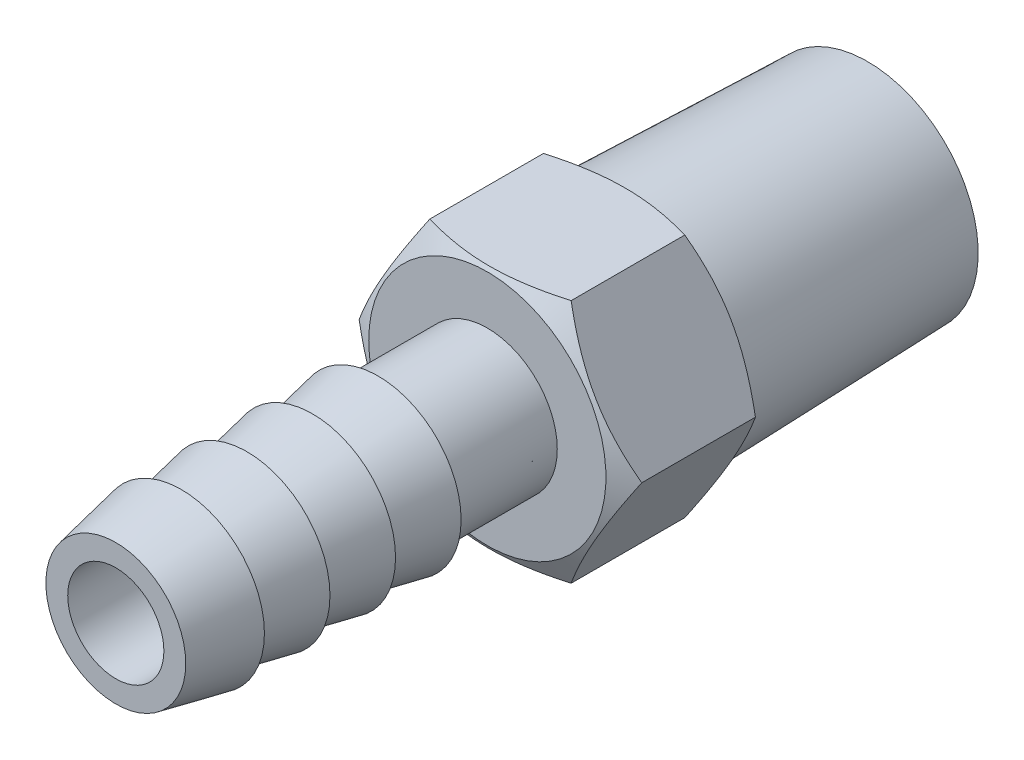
ISO-10303-21;
HEADER;
FILE_DESCRIPTION(('STEP AP214'),'2;1');
FILE_NAME('part.step','',(''),(''),'','','');
FILE_SCHEMA(('AUTOMOTIVE_DESIGN { 1 0 10303 214 1 1 1 1 }'));
ENDSEC;
DATA;
#1=APPLICATION_CONTEXT('core data for automotive mechanical design processes');
#2=APPLICATION_PROTOCOL_DEFINITION('international standard','automotive_design',2000,#1);
#3=PRODUCT_CONTEXT('',#1,'mechanical');
#4=PRODUCT('Part','Part','',(#3));
#5=PRODUCT_RELATED_PRODUCT_CATEGORY('part','',(#4));
#6=PRODUCT_DEFINITION_FORMATION('','',#4);
#7=PRODUCT_DEFINITION_CONTEXT('part definition',#1,'design');
#8=PRODUCT_DEFINITION('design','',#6,#7);
#9=PRODUCT_DEFINITION_SHAPE('','',#8);
#10=(LENGTH_UNIT() NAMED_UNIT(*) SI_UNIT(.MILLI.,.METRE.));
#11=(NAMED_UNIT(*) PLANE_ANGLE_UNIT() SI_UNIT($,.RADIAN.));
#12=(NAMED_UNIT(*) SI_UNIT($,.STERADIAN.) SOLID_ANGLE_UNIT());
#13=UNCERTAINTY_MEASURE_WITH_UNIT(LENGTH_MEASURE(1.E-05),#10,'distance_accuracy_value','');
#14=(GEOMETRIC_REPRESENTATION_CONTEXT(3) GLOBAL_UNCERTAINTY_ASSIGNED_CONTEXT((#13)) GLOBAL_UNIT_ASSIGNED_CONTEXT((#10,
#11,#12)) REPRESENTATION_CONTEXT('',''));
#15=CARTESIAN_POINT('',(0.,0.,0.));
#16=DIRECTION('',(0.,0.,1.));
#17=DIRECTION('',(1.,0.,0.));
#18=AXIS2_PLACEMENT_3D('',#15,#16,#17);
#19=CARTESIAN_POINT('',(4.10611511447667,-7.11199999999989,-4.44089209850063E-13));
#20=DIRECTION('',(0.,0.,-1.));
#21=DIRECTION('',(-0.999999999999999,0.,0.));
#22=AXIS2_PLACEMENT_3D('',#19,#20,#21);
#23=PLANE('',#22);
#24=CARTESIAN_POINT('',(0.,0.,0.));
#25=DIRECTION('',(0.,0.,-1.));
#26=DIRECTION('',(-0.999999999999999,0.,0.));
#27=AXIS2_PLACEMENT_3D('',#24,#25,#26);
#28=CIRCLE('',#27,6.89240751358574);
#29=CARTESIAN_POINT('',(-6.89240751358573,0.,0.));
#30=VERTEX_POINT('',#29);
#31=EDGE_CURVE('E116',#30,#30,#28,.T.);
#32=ORIENTED_EDGE('',*,*,#31,.T.);
#33=EDGE_LOOP('',(#32));
#34=FACE_BOUND('',#33,.T.);
#35=CARTESIAN_POINT('',(0.,0.,0.));
#36=DIRECTION('',(0.,0.,-1.));
#37=DIRECTION('',(-0.999999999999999,0.,0.));
#38=AXIS2_PLACEMENT_3D('',#35,#36,#37);
#39=CIRCLE('',#38,6.858);
#40=CARTESIAN_POINT('',(-6.858,0.,0.));
#41=VERTEX_POINT('',#40);
#42=EDGE_CURVE('E128',#41,#41,#39,.T.);
#43=ORIENTED_EDGE('',*,*,#42,.F.);
#44=EDGE_LOOP('',(#43));
#45=FACE_BOUND('',#44,.T.);
#46=ADVANCED_FACE('F32',(#34,#45),#23,.T.);
#47=CARTESIAN_POINT('',(4.10611511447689,-7.112,8.12800000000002));
#48=DIRECTION('',(0.,0.,-1.));
#49=DIRECTION('',(-0.999999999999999,0.,0.));
#50=AXIS2_PLACEMENT_3D('',#47,#48,#49);
#51=PLANE('',#50);
#52=CARTESIAN_POINT('',(3.33066907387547E-13,1.76941794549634E-13,8.12799999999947));
#53=DIRECTION('',(0.,0.,1.));
#54=DIRECTION('',(0.999999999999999,0.,0.));
#55=AXIS2_PLACEMENT_3D('',#52,#53,#54);
#56=CIRCLE('',#55,4.064);
#57=CARTESIAN_POINT('',(4.06400000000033,1.76716197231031E-13,8.12799999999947));
#58=VERTEX_POINT('',#57);
#59=EDGE_CURVE('E246',#58,#58,#56,.T.);
#60=ORIENTED_EDGE('',*,*,#59,.F.);
#61=EDGE_LOOP('',(#60));
#62=FACE_BOUND('',#61,.T.);
#63=CARTESIAN_POINT('',(3.33066907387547E-13,1.76941794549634E-13,8.12799999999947));
#64=DIRECTION('',(0.,0.,-1.));
#65=DIRECTION('',(-0.999999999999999,0.,0.));
#66=AXIS2_PLACEMENT_3D('',#63,#64,#65);
#67=CIRCLE('',#66,6.89240751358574);
#68=CARTESIAN_POINT('',(-6.8924075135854,1.77324400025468E-13,8.12799999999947));
#69=VERTEX_POINT('',#68);
#70=EDGE_CURVE('E37',#69,#69,#67,.T.);
#71=ORIENTED_EDGE('',*,*,#70,.F.);
#72=EDGE_LOOP('',(#71));
#73=FACE_BOUND('',#72,.T.);
#74=ADVANCED_FACE('F150',(#62,#73),#51,.F.);
#75=CARTESIAN_POINT('',(6.66133814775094E-13,0.,7.36599999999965));
#76=DIRECTION('',(0.,0.,-1.));
#77=DIRECTION('',(-0.999999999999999,0.,0.));
#78=AXIS2_PLACEMENT_3D('',#75,#76,#77);
#79=CONICAL_SURFACE('',#78,8.21223022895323,1.0471975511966);
#80=ORIENTED_EDGE('',*,*,#70,.T.);
#81=EDGE_LOOP('',(#80));
#82=FACE_BOUND('',#81,.T.);
#83=CARTESIAN_POINT('',(4.10599964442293,-7.11219999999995,7.36593333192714));
#84=CARTESIAN_POINT('',(4.19625667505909,-6.955870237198,7.41803539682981));
#85=CARTESIAN_POINT('',(4.28685022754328,-6.79895760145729,7.46777287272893));
#86=CARTESIAN_POINT('',(4.46877304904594,-6.48385803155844,7.56186739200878));
#87=CARTESIAN_POINT('',(4.56010261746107,-6.32567057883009,7.6062221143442));
#88=CARTESIAN_POINT('',(4.83555361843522,-5.84857545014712,7.73034153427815));
#89=CARTESIAN_POINT('',(5.02076234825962,-5.52778452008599,7.80093924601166));
#90=CARTESIAN_POINT('',(5.29792384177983,-5.04772673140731,7.8837233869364));
#91=CARTESIAN_POINT('',(5.38904848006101,-4.88989422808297,7.90730619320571));
#92=CARTESIAN_POINT('',(5.57170949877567,-4.57351606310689,7.94685112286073));
#93=CARTESIAN_POINT('',(5.66324584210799,-4.41497046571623,7.96281391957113));
#94=CARTESIAN_POINT('',(5.84647750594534,-4.09760391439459,7.98671201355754));
#95=CARTESIAN_POINT('',(5.93817252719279,-3.93878347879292,7.99465642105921));
#96=CARTESIAN_POINT('',(6.12164220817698,-3.62100466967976,8.00235591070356));
#97=CARTESIAN_POINT('',(6.21341686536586,-3.46204630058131,8.00211124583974));
#98=CARTESIAN_POINT('',(6.46484880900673,-3.02655339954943,7.9901846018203));
#99=CARTESIAN_POINT('',(6.62442378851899,-2.75016142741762,7.97016327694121));
#100=CARTESIAN_POINT('',(6.94251386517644,-2.19921325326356,7.90667580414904));
#101=CARTESIAN_POINT('',(7.10102784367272,-1.92465898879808,7.8631879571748));
#102=CARTESIAN_POINT('',(7.41975806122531,-1.37260205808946,7.75448108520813));
#103=CARTESIAN_POINT('',(7.5799340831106,-1.09516905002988,7.68880148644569));
#104=CARTESIAN_POINT('',(7.89789746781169,-0.544440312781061,7.53973534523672));
#105=CARTESIAN_POINT('',(8.05568890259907,-0.27113753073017,7.45638381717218));
#106=CARTESIAN_POINT('',(8.21234569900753,0.000200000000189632,7.36593333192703));
#107=B_SPLINE_CURVE_WITH_KNOTS('',3,(#83,#84,#85,#86,#87,#88,#89,#90,#91,#92,#93,#94,#95,#96,
#97,#98,#99,#100,#101,#102,#103,#104,#105,#106),.UNSPECIFIED.,.F.,.F.,(4,2,2,2,2,2,2,2,2,2,2,4),
(0.,0.563603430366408,1.12744902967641,2.2574831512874,2.80866066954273,3.35978947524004,
3.91029139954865,4.46077631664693,5.41910279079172,6.37831693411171,7.35880500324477,
8.33736823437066),.UNSPECIFIED.);
#108=CARTESIAN_POINT('',(4.10611511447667,-7.11199999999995,7.36599999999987));
#109=VERTEX_POINT('',#108);
#110=CARTESIAN_POINT('',(8.21223022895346,0.,7.36599999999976));
#111=VERTEX_POINT('',#110);
#112=EDGE_CURVE('E203',#109,#111,#107,.T.);
#113=ORIENTED_EDGE('',*,*,#112,.T.);
#114=CARTESIAN_POINT('',(8.21234569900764,-0.000200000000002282,7.36593333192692));
#115=CARTESIAN_POINT('',(8.12208866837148,0.156129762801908,7.41803539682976));
#116=CARTESIAN_POINT('',(8.03149511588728,0.313042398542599,7.46777287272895));
#117=CARTESIAN_POINT('',(7.8495722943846,0.628141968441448,7.56186739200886));
#118=CARTESIAN_POINT('',(7.75824272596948,0.786329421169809,7.60622211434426));
#119=CARTESIAN_POINT('',(7.48279172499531,1.26342454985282,7.73034153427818));
#120=CARTESIAN_POINT('',(7.2975829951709,1.58421547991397,7.8009392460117));
#121=CARTESIAN_POINT('',(7.02042150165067,2.06427326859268,7.88372338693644));
#122=CARTESIAN_POINT('',(6.92929686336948,2.22210577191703,7.90730619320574));
#123=CARTESIAN_POINT('',(6.74663584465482,2.53848393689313,7.94685112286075));
#124=CARTESIAN_POINT('',(6.65509950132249,2.69702953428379,7.96281391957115));
#125=CARTESIAN_POINT('',(6.47186783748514,3.01439608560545,7.98671201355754));
#126=CARTESIAN_POINT('',(6.38017281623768,3.17321652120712,7.99465642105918));
#127=CARTESIAN_POINT('',(6.19670313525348,3.49099533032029,8.00235591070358));
#128=CARTESIAN_POINT('',(6.1049284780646,3.64995369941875,8.00211124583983));
#129=CARTESIAN_POINT('',(5.85349653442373,4.08544660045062,7.99018460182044));
#130=CARTESIAN_POINT('',(5.69392155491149,4.36183857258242,7.97016327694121));
#131=CARTESIAN_POINT('',(5.37583147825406,4.91278674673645,7.90667580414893));
#132=CARTESIAN_POINT('',(5.21731749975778,5.18734101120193,7.86318795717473));
#133=CARTESIAN_POINT('',(4.8985872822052,5.73939794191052,7.75448108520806));
#134=CARTESIAN_POINT('',(4.73841126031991,6.01683094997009,7.68880148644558));
#135=CARTESIAN_POINT('',(4.42044787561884,6.56755968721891,7.53973534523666));
#136=CARTESIAN_POINT('',(4.26265644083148,6.84086246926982,7.45638381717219));
#137=CARTESIAN_POINT('',(4.10599964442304,7.11220000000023,7.36593333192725));
#138=B_SPLINE_CURVE_WITH_KNOTS('',3,(#114,#115,#116,#117,#118,#119,#120,#121,#122,#123,#124,
#125,#126,#127,#128,#129,#130,#131,#132,#133,#134,#135,#136,#137),.UNSPECIFIED.,.F.,.F.,(4,2,2,
2,2,2,2,2,2,2,2,4),(0.,0.563603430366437,1.12744902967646,2.25748315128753,2.80866066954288,
3.35978947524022,3.91029139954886,4.46077631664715,5.4191027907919,6.37831693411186,
7.35880500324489,8.33736823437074),.UNSPECIFIED.);
#139=CARTESIAN_POINT('',(4.10611511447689,7.112,7.36599999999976));
#140=VERTEX_POINT('',#139);
#141=EDGE_CURVE('E198',#111,#140,#138,.T.);
#142=ORIENTED_EDGE('',*,*,#141,.T.);
#143=CARTESIAN_POINT('',(-10.8724474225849,7.112,4.60642989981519));
#144=CARTESIAN_POINT('',(-10.5603268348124,7.112,4.75719073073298));
#145=CARTESIAN_POINT('',(-10.2474663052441,7.112,4.90644747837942));
#146=CARTESIAN_POINT('',(-9.6198651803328,7.112,5.20109290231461));
#147=CARTESIAN_POINT('',(-9.30512426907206,7.112,5.34648090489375));
#148=CARTESIAN_POINT('',(-8.67165327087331,7.112,5.63329869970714));
#149=CARTESIAN_POINT('',(-8.35291065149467,7.112,5.77470091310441));
#150=CARTESIAN_POINT('',(-7.71279917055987,7.112,6.05140640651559));
#151=CARTESIAN_POINT('',(-7.39143044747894,7.112,6.18671000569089));
#152=CARTESIAN_POINT('',(-6.74164774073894,7.112,6.45116857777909));
#153=CARTESIAN_POINT('',(-6.41319550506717,7.112,6.58023008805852));
#154=CARTESIAN_POINT('',(-5.75241156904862,7.112,6.82820116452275));
#155=CARTESIAN_POINT('',(-5.42007944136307,7.112,6.94710960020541));
#156=CARTESIAN_POINT('',(-4.7516913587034,7.112,7.17156616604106));
#157=CARTESIAN_POINT('',(-4.41564510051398,7.112,7.27714285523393));
#158=CARTESIAN_POINT('',(-3.73878811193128,7.112,7.4714975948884));
#159=CARTESIAN_POINT('',(-3.39797892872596,7.112,7.56028097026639));
#160=CARTESIAN_POINT('',(-2.71129932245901,7.112,7.71672274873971));
#161=CARTESIAN_POINT('',(-2.36542736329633,7.112,7.78437459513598));
#162=CARTESIAN_POINT('',(-1.84359121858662,7.112,7.86660617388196));
#163=CARTESIAN_POINT('',(-1.66911982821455,7.112,7.89081076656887));
#164=CARTESIAN_POINT('',(-1.31936448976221,7.112,7.93232813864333));
#165=CARTESIAN_POINT('',(-1.1440806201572,7.112,7.94964157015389));
#166=CARTESIAN_POINT('',(-0.794039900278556,7.112,7.97691139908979));
#167=CARTESIAN_POINT('',(-0.6192865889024,7.112,7.98691304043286));
#168=CARTESIAN_POINT('',(-0.269513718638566,7.112,7.99950670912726));
#169=CARTESIAN_POINT('',(-0.0944941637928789,7.112,8.00209884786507));
#170=CARTESIAN_POINT('',(0.255447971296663,7.112,7.99981184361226));
#171=CARTESIAN_POINT('',(0.430370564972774,7.112,7.99493478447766));
#172=CARTESIAN_POINT('',(0.779858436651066,7.112,7.97783019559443));
#173=CARTESIAN_POINT('',(0.954423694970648,7.11200000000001,7.96560227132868));
#174=CARTESIAN_POINT('',(1.37795298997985,7.11200000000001,7.92727165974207));
#175=CARTESIAN_POINT('',(1.6265880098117,7.11200000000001,7.89746185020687));
#176=CARTESIAN_POINT('',(2.12189843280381,7.112,7.82459378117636));
#177=CARTESIAN_POINT('',(2.36857353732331,7.112,7.78153354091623));
#178=CARTESIAN_POINT('',(3.10609516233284,7.112,7.63463810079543));
#179=CARTESIAN_POINT('',(3.5934729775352,7.112,7.51318660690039));
#180=CARTESIAN_POINT('',(4.32247428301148,7.112,7.30391516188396));
#181=CARTESIAN_POINT('',(4.567910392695,7.112,7.22862419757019));
#182=CARTESIAN_POINT('',(5.05641163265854,7.112,7.07057054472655));
#183=CARTESIAN_POINT('',(5.29947654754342,7.112,6.98780718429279));
#184=CARTESIAN_POINT('',(5.78202202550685,7.112,6.81657952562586));
#185=CARTESIAN_POINT('',(6.02151508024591,7.112,6.72815007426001));
#186=CARTESIAN_POINT('',(6.49846529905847,7.11200000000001,6.54619233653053));
#187=CARTESIAN_POINT('',(6.73592313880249,7.11200000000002,6.45266582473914));
#188=CARTESIAN_POINT('',(6.97252441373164,7.11200000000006,6.35706839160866));
#189=B_SPLINE_CURVE_WITH_KNOTS('',3,(#143,#144,#145,#146,#147,#148,#149,#150,#151,#152,#153,
#154,#155,#156,#157,#158,#159,#160,#161,#162,#163,#164,#165,#166,#167,#168,#169,#170,#171,#172,
#173,#174,#175,#176,#177,#178,#179,#180,#181,#182,#183,#184,#185,#186,#187,#188),.UNSPECIFIED.,
.F.,.F.,(4,2,2,2,2,2,2,2,2,2,2,2,2,2,2,2,2,2,2,2,2,2,4),(0.,1.03988557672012,2.07995107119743,
3.12599920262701,4.17199252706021,5.23055951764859,6.2892442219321,7.34562110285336,
8.40166245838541,9.45803115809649,9.98634345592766,10.5146057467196,11.0395709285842,
11.5645282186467,12.0893390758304,12.6141781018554,13.3649981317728,14.1159304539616,
15.6206922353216,16.3908071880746,17.1609914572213,17.9268248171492,18.692393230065),.UNSPECIFIED.);
#190=CARTESIAN_POINT('',(-4.10611511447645,7.11200000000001,7.36599999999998));
#191=VERTEX_POINT('',#190);
#192=EDGE_CURVE('E191',#140,#191,#189,.F.);
#193=ORIENTED_EDGE('',*,*,#192,.T.);
#194=CARTESIAN_POINT('',(-4.1059996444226,7.11220000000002,7.36593333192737));
#195=CARTESIAN_POINT('',(-4.1962566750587,6.95587023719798,7.41803539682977));
#196=CARTESIAN_POINT('',(-4.28685022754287,6.79895760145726,7.46777287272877));
#197=CARTESIAN_POINT('',(-4.4687730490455,6.48385803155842,7.56186739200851));
#198=CARTESIAN_POINT('',(-4.56010261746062,6.3256705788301,7.60622211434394));
#199=CARTESIAN_POINT('',(-4.83555361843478,5.84857545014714,7.7303415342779));
#200=CARTESIAN_POINT('',(-5.02076234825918,5.52778452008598,7.80093924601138));
#201=CARTESIAN_POINT('',(-5.2979238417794,5.04772673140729,7.88372338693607));
#202=CARTESIAN_POINT('',(-5.38904848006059,4.88989422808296,7.90730619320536));
#203=CARTESIAN_POINT('',(-5.57170949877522,4.57351606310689,7.94685112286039));
#204=CARTESIAN_POINT('',(-5.66324584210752,4.41497046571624,7.96281391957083));
#205=CARTESIAN_POINT('',(-5.84647750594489,4.09760391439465,7.98671201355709));
#206=CARTESIAN_POINT('',(-5.93817252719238,3.93878347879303,7.99465642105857));
#207=CARTESIAN_POINT('',(-6.1216422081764,3.62100466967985,8.00235591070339));
#208=CARTESIAN_POINT('',(-6.21341686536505,3.46204630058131,8.00211124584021));
#209=CARTESIAN_POINT('',(-6.46484880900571,3.02655339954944,7.9901846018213));
#210=CARTESIAN_POINT('',(-6.62442378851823,2.7501614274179,7.97016327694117));
#211=CARTESIAN_POINT('',(-6.94251386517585,2.19921325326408,7.90667580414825));
#212=CARTESIAN_POINT('',(-7.10102784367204,1.92465898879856,7.8631879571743));
#213=CARTESIAN_POINT('',(-7.41975806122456,1.37260205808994,7.75448108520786));
#214=CARTESIAN_POINT('',(-7.57993408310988,1.09516905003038,7.68880148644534));
#215=CARTESIAN_POINT('',(-7.89789746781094,0.544440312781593,7.53973534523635));
#216=CARTESIAN_POINT('',(-8.05568890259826,0.271137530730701,7.45638381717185));
#217=CARTESIAN_POINT('',(-8.21234569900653,-0.000199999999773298,7.36593333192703));
#218=B_SPLINE_CURVE_WITH_KNOTS('',3,(#194,#195,#196,#197,#198,#199,#200,#201,#202,#203,#204,
#205,#206,#207,#208,#209,#210,#211,#212,#213,#214,#215,#216,#217),.UNSPECIFIED.,.F.,.F.,(4,2,2,
2,2,2,2,2,2,2,2,4),(0.,0.56360343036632,1.12744902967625,2.25748315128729,2.8086606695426,
3.35978947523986,3.9102913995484,4.46077631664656,5.41910279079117,6.37831693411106,
7.35880500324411,8.33736823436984),.UNSPECIFIED.);
#219=CARTESIAN_POINT('',(-8.21223022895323,0.,7.36599999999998));
#220=VERTEX_POINT('',#219);
#221=EDGE_CURVE('E185',#191,#220,#218,.T.);
#222=ORIENTED_EDGE('',*,*,#221,.T.);
#223=CARTESIAN_POINT('',(-8.21234569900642,0.000200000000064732,7.36593333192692));
#224=CARTESIAN_POINT('',(-8.12208866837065,-0.156129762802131,7.41803539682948));
#225=CARTESIAN_POINT('',(-8.03149511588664,-0.313042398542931,7.46777287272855));
#226=CARTESIAN_POINT('',(-7.84957229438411,-0.628141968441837,7.56186739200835));
#227=CARTESIAN_POINT('',(-7.75824272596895,-0.786329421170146,7.60622211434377));
#228=CARTESIAN_POINT('',(-7.48279172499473,-1.26342454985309,7.73034153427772));
#229=CARTESIAN_POINT('',(-7.29758299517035,-1.58421547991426,7.80093924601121));
#230=CARTESIAN_POINT('',(-7.02042150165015,-2.06427326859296,7.88372338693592));
#231=CARTESIAN_POINT('',(-6.92929686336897,-2.22210577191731,7.90730619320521));
#232=CARTESIAN_POINT('',(-6.7466358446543,-2.53848393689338,7.94685112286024));
#233=CARTESIAN_POINT('',(-6.65509950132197,-2.69702953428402,7.96281391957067));
#234=CARTESIAN_POINT('',(-6.47186783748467,-3.01439608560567,7.98671201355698));
#235=CARTESIAN_POINT('',(-6.38017281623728,-3.17321652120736,7.99465642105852));
#236=CARTESIAN_POINT('',(-6.19670313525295,-3.4909953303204,8.00235591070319));
#237=CARTESIAN_POINT('',(-6.10492847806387,-3.64995369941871,8.00211124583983));
#238=CARTESIAN_POINT('',(-5.85349653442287,-4.08544660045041,7.99018460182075));
#239=CARTESIAN_POINT('',(-5.693921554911,-4.36183857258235,7.97016327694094));
#240=CARTESIAN_POINT('',(-5.37583147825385,-4.91278674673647,7.90667580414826));
#241=CARTESIAN_POINT('',(-5.21731749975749,-5.18734101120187,7.86318795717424));
#242=CARTESIAN_POINT('',(-4.89858728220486,-5.73939794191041,7.75448108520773));
#243=CARTESIAN_POINT('',(-4.73841126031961,-6.01683094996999,7.68880148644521));
#244=CARTESIAN_POINT('',(-4.42044787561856,-6.56755968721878,7.53973534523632));
#245=CARTESIAN_POINT('',(-4.26265644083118,-6.84086246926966,7.45638381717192));
#246=CARTESIAN_POINT('',(-4.1059996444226,-7.11220000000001,7.36593333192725));
#247=B_SPLINE_CURVE_WITH_KNOTS('',3,(#223,#224,#225,#226,#227,#228,#229,#230,#231,#232,#233,
#234,#235,#236,#237,#238,#239,#240,#241,#242,#243,#244,#245,#246),.UNSPECIFIED.,.F.,.F.,(4,2,2,
2,2,2,2,2,2,2,2,4),(0.,0.563603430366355,1.12744902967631,2.25748315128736,2.80866066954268,
3.35978947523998,3.91029139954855,4.46077631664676,5.41910279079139,6.37831693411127,
7.35880500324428,8.33736823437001),.UNSPECIFIED.);
#248=CARTESIAN_POINT('',(-4.10611511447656,-7.11199999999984,7.36599999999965));
#249=VERTEX_POINT('',#248);
#250=EDGE_CURVE('E50',#220,#249,#247,.T.);
#251=ORIENTED_EDGE('',*,*,#250,.T.);
#252=CARTESIAN_POINT('',(-10.872447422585,-7.11199999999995,4.60642989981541));
#253=CARTESIAN_POINT('',(-10.5603268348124,-7.11199999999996,4.75719073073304));
#254=CARTESIAN_POINT('',(-10.2474663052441,-7.11199999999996,4.90644747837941));
#255=CARTESIAN_POINT('',(-9.61986518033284,-7.11199999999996,5.20109290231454));
#256=CARTESIAN_POINT('',(-9.30512426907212,-7.11199999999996,5.34648090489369));
#257=CARTESIAN_POINT('',(-8.6716532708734,-7.11199999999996,5.63329869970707));
#258=CARTESIAN_POINT('',(-8.35291065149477,-7.11199999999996,5.77470091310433));
#259=CARTESIAN_POINT('',(-7.71279917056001,-7.11199999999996,6.0514064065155));
#260=CARTESIAN_POINT('',(-7.39143044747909,-7.11199999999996,6.18671000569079));
#261=CARTESIAN_POINT('',(-6.74164774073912,-7.11199999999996,6.45116857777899));
#262=CARTESIAN_POINT('',(-6.41319550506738,-7.11199999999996,6.5802300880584));
#263=CARTESIAN_POINT('',(-5.75241156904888,-7.11199999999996,6.82820116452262));
#264=CARTESIAN_POINT('',(-5.42007944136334,-7.11199999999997,6.94710960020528));
#265=CARTESIAN_POINT('',(-4.75169135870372,-7.11199999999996,7.17156616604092));
#266=CARTESIAN_POINT('',(-4.41564510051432,-7.11199999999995,7.27714285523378));
#267=CARTESIAN_POINT('',(-3.73878811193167,-7.11199999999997,7.47149759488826));
#268=CARTESIAN_POINT('',(-3.39797892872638,-7.112,7.56028097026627));
#269=CARTESIAN_POINT('',(-2.71129932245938,-7.112,7.71672274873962));
#270=CARTESIAN_POINT('',(-2.36542736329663,-7.11199999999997,7.78437459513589));
#271=CARTESIAN_POINT('',(-1.8435912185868,-7.11199999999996,7.86660617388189));
#272=CARTESIAN_POINT('',(-1.6691198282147,-7.11199999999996,7.8908107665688));
#273=CARTESIAN_POINT('',(-1.31936448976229,-7.11199999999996,7.93232813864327));
#274=CARTESIAN_POINT('',(-1.14408062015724,-7.11199999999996,7.94964157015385));
#275=CARTESIAN_POINT('',(-0.794039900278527,-7.11199999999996,7.97691139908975));
#276=CARTESIAN_POINT('',(-0.619286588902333,-7.11199999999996,7.98691304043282));
#277=CARTESIAN_POINT('',(-0.269513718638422,-7.11199999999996,7.99950670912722));
#278=CARTESIAN_POINT('',(-0.0944941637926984,-7.11199999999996,8.00209884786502));
#279=CARTESIAN_POINT('',(0.255447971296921,-7.11199999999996,7.99981184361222));
#280=CARTESIAN_POINT('',(0.430370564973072,-7.11199999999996,7.99493478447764));
#281=CARTESIAN_POINT('',(0.779858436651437,-7.11199999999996,7.97783019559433));
#282=CARTESIAN_POINT('',(0.954423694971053,-7.11199999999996,7.96560227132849));
#283=CARTESIAN_POINT('',(1.37795298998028,-7.11199999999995,7.92727165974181));
#284=CARTESIAN_POINT('',(1.62658800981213,-7.11199999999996,7.89746185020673));
#285=CARTESIAN_POINT('',(2.12189843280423,-7.11199999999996,7.82459378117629));
#286=CARTESIAN_POINT('',(2.36857353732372,-7.11199999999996,7.78153354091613));
#287=CARTESIAN_POINT('',(3.1060951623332,-7.11199999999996,7.63463810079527));
#288=CARTESIAN_POINT('',(3.59347297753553,-7.11199999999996,7.51318660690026));
#289=CARTESIAN_POINT('',(4.32247428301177,-7.11199999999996,7.30391516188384));
#290=CARTESIAN_POINT('',(4.56791039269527,-7.11199999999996,7.22862419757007));
#291=CARTESIAN_POINT('',(5.05641163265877,-7.11199999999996,7.07057054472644));
#292=CARTESIAN_POINT('',(5.29947654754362,-7.11199999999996,6.98780718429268));
#293=CARTESIAN_POINT('',(5.78202202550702,-7.11199999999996,6.81657952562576));
#294=CARTESIAN_POINT('',(6.02151508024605,-7.11199999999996,6.72815007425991));
#295=CARTESIAN_POINT('',(6.49846529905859,-7.11199999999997,6.54619233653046));
#296=CARTESIAN_POINT('',(6.7359231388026,-7.11199999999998,6.45266582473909));
#297=CARTESIAN_POINT('',(6.97252441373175,-7.11200000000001,6.35706839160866));
#298=B_SPLINE_CURVE_WITH_KNOTS('',3,(#252,#253,#254,#255,#256,#257,#258,#259,#260,#261,#262,
#263,#264,#265,#266,#267,#268,#269,#270,#271,#272,#273,#274,#275,#276,#277,#278,#279,#280,#281,
#282,#283,#284,#285,#286,#287,#288,#289,#290,#291,#292,#293,#294,#295,#296,#297),.UNSPECIFIED.,
.F.,.F.,(4,2,2,2,2,2,2,2,2,2,2,2,2,2,2,2,2,2,2,2,2,2,4),(0.,1.03988557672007,2.07995107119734,
3.12599920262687,4.17199252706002,5.23055951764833,6.28924422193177,7.34562110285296,
8.40166245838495,9.45803115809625,9.98634345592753,10.5146057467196,11.0395709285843,
11.5645282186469,12.0893390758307,12.6141781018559,13.3649981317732,14.1159304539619,
15.6206922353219,16.3908071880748,17.1609914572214,17.9268248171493,18.6923932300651),.UNSPECIFIED.);
#299=EDGE_CURVE('E155',#249,#109,#298,.T.);
#300=ORIENTED_EDGE('',*,*,#299,.T.);
#301=EDGE_LOOP('',(#113,#142,#193,#222,#251,#300));
#302=FACE_BOUND('',#301,.T.);
#303=ADVANCED_FACE('F172',(#82,#302),#79,.T.);
#304=CARTESIAN_POINT('',(4.10611511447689,-7.112,8.12800000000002));
#305=DIRECTION('',(-0.866025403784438,0.5,0.));
#306=DIRECTION('',(-0.500000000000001,-0.866025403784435,0.));
#307=AXIS2_PLACEMENT_3D('',#304,#305,#306);
#308=PLANE('',#307);
#309=CARTESIAN_POINT('',(8.21234569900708,0.000199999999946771,0.762066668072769));
#310=CARTESIAN_POINT('',(8.12208866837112,-0.156129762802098,0.709964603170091));
#311=CARTESIAN_POINT('',(8.03149511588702,-0.313042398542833,0.660227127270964));
#312=CARTESIAN_POINT('',(7.84957229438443,-0.62814196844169,0.566132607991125));
#313=CARTESIAN_POINT('',(7.75824272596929,-0.786329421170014,0.52177788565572));
#314=CARTESIAN_POINT('',(7.4827917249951,-1.26342454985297,0.397658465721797));
#315=CARTESIAN_POINT('',(7.29758299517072,-1.58421547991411,0.327060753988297));
#316=CARTESIAN_POINT('',(7.02042150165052,-2.0642732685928,0.244276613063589));
#317=CARTESIAN_POINT('',(6.92929686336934,-2.22210577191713,0.220693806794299));
#318=CARTESIAN_POINT('',(6.74663584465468,-2.53848393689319,0.181148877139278));
#319=CARTESIAN_POINT('',(6.65509950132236,-2.69702953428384,0.165186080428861));
#320=CARTESIAN_POINT('',(6.47186783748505,-3.01439608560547,0.141287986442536));
#321=CARTESIAN_POINT('',(6.38017281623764,-3.17321652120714,0.133343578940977));
#322=CARTESIAN_POINT('',(6.19670313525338,-3.49099533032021,0.125644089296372));
#323=CARTESIAN_POINT('',(6.1049284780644,-3.64995369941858,0.125888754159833));
#324=CARTESIAN_POINT('',(5.85349653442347,-4.08544660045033,0.13781539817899));
#325=CARTESIAN_POINT('',(5.69392155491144,-4.36183857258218,0.157836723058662));
#326=CARTESIAN_POINT('',(5.37583147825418,-4.91278674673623,0.221324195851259));
#327=CARTESIAN_POINT('',(5.21731749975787,-5.18734101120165,0.264812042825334));
#328=CARTESIAN_POINT('',(4.89858728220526,-5.7393979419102,0.373518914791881));
#329=CARTESIAN_POINT('',(4.73841126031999,-6.01683094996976,0.439198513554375));
#330=CARTESIAN_POINT('',(4.42044787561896,-6.56755968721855,0.588264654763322));
#331=CARTESIAN_POINT('',(4.26265644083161,-6.84086246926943,0.671616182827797));
#332=CARTESIAN_POINT('',(4.10599964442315,-7.1121999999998,0.762066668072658));
#333=B_SPLINE_CURVE_WITH_KNOTS('',3,(#309,#310,#311,#312,#313,#314,#315,#316,#317,#318,#319,
#320,#321,#322,#323,#324,#325,#326,#327,#328,#329,#330,#331,#332),.UNSPECIFIED.,.F.,.F.,(4,2,2,
2,2,2,2,2,2,2,2,4),(0.,0.563603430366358,1.12744902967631,2.25748315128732,2.80866066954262,
3.3597894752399,3.91029139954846,4.46077631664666,5.4191027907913,6.37831693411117,
7.35880500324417,8.33736823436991),.UNSPECIFIED.);
#334=CARTESIAN_POINT('',(8.21223022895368,0.,0.761999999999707));
#335=VERTEX_POINT('',#334);
#336=CARTESIAN_POINT('',(4.106115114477,-7.1119999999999,0.76200000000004));
#337=VERTEX_POINT('',#336);
#338=EDGE_CURVE('E58',#335,#337,#333,.T.);
#339=ORIENTED_EDGE('',*,*,#338,.F.);
#340=DIRECTION('',(0.,0.,-1.));
#341=VECTOR('',#340,1.);
#342=CARTESIAN_POINT('',(8.21223022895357,0.,8.12799999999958));
#343=LINE('',#342,#341);
#344=EDGE_CURVE('E11',#111,#335,#343,.T.);
#345=ORIENTED_EDGE('',*,*,#344,.F.);
#346=ORIENTED_EDGE('',*,*,#112,.F.);
#347=DIRECTION('',(0.,0.,-1.));
#348=VECTOR('',#347,1.);
#349=CARTESIAN_POINT('',(4.10611511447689,-7.112,8.12800000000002));
#350=LINE('',#349,#348);
#351=EDGE_CURVE('E111',#109,#337,#350,.T.);
#352=ORIENTED_EDGE('',*,*,#351,.T.);
#353=EDGE_LOOP('',(#339,#345,#346,#352));
#354=FACE_BOUND('',#353,.T.);
#355=ADVANCED_FACE('F34',(#354),#308,.F.);
#356=CARTESIAN_POINT('',(8.21223022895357,0.,8.12799999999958));
#357=DIRECTION('',(-0.866025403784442,-0.499999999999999,0.));
#358=DIRECTION('',(0.500000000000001,-0.866025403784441,0.));
#359=AXIS2_PLACEMENT_3D('',#356,#357,#358);
#360=PLANE('',#359);
#361=CARTESIAN_POINT('',(4.10599964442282,7.11220000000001,0.762066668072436));
#362=CARTESIAN_POINT('',(4.19625667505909,6.95587023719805,0.709964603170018));
#363=CARTESIAN_POINT('',(4.28685022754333,6.79895760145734,0.660227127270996));
#364=CARTESIAN_POINT('',(4.46877304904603,6.48385803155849,0.566132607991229));
#365=CARTESIAN_POINT('',(4.56010261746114,6.32567057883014,0.521777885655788));
#366=CARTESIAN_POINT('',(4.8355536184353,5.84857545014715,0.397658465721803));
#367=CARTESIAN_POINT('',(5.02076234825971,5.52778452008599,0.327060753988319));
#368=CARTESIAN_POINT('',(5.29792384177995,5.04772673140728,0.244276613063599));
#369=CARTESIAN_POINT('',(5.38904848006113,4.88989422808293,0.220693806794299));
#370=CARTESIAN_POINT('',(5.5717094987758,4.57351606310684,0.181148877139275));
#371=CARTESIAN_POINT('',(5.66324584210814,4.41497046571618,0.165186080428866));
#372=CARTESIAN_POINT('',(5.84647750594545,4.09760391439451,0.141287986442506));
#373=CARTESIAN_POINT('',(5.93817252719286,3.93878347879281,0.133343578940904));
#374=CARTESIAN_POINT('',(6.12164220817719,3.62100466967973,0.125644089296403));
#375=CARTESIAN_POINT('',(6.21341686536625,3.46204630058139,0.125888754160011));
#376=CARTESIAN_POINT('',(6.46484880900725,3.02655339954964,0.137815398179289));
#377=CARTESIAN_POINT('',(6.62442378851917,2.75016142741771,0.157836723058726));
#378=CARTESIAN_POINT('',(6.94251386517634,2.19921325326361,0.221324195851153));
#379=CARTESIAN_POINT('',(7.10102784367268,1.92465898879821,0.264812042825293));
#380=CARTESIAN_POINT('',(7.41975806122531,1.3726020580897,0.37351891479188));
#381=CARTESIAN_POINT('',(7.57993408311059,1.09516905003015,0.439198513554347));
#382=CARTESIAN_POINT('',(7.89789746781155,0.544440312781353,0.588264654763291));
#383=CARTESIAN_POINT('',(8.05568890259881,0.271137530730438,0.67161618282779));
#384=CARTESIAN_POINT('',(8.21234569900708,-0.000200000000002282,0.762066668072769));
#385=B_SPLINE_CURVE_WITH_KNOTS('',3,(#361,#362,#363,#364,#365,#366,#367,#368,#369,#370,#371,
#372,#373,#374,#375,#376,#377,#378,#379,#380,#381,#382,#383,#384),.UNSPECIFIED.,.F.,.F.,(4,2,2,
2,2,2,2,2,2,2,2,4),(0.,0.563603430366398,1.1274490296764,2.25748315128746,2.80866066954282,
3.35978947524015,3.91029139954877,4.46077631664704,5.41910279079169,6.37831693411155,
7.3588050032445,8.33736823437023),.UNSPECIFIED.);
#386=CARTESIAN_POINT('',(4.10611511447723,7.11200000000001,0.761999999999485));
#387=VERTEX_POINT('',#386);
#388=EDGE_CURVE('E215',#387,#335,#385,.T.);
#389=ORIENTED_EDGE('',*,*,#388,.F.);
#390=DIRECTION('',(0.,0.,-1.));
#391=VECTOR('',#390,1.);
#392=CARTESIAN_POINT('',(4.10611511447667,7.112,8.12800000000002));
#393=LINE('',#392,#391);
#394=EDGE_CURVE('E42',#140,#387,#393,.T.);
#395=ORIENTED_EDGE('',*,*,#394,.F.);
#396=ORIENTED_EDGE('',*,*,#141,.F.);
#397=ORIENTED_EDGE('',*,*,#344,.T.);
#398=EDGE_LOOP('',(#389,#395,#396,#397));
#399=FACE_BOUND('',#398,.T.);
#400=ADVANCED_FACE('F208',(#399),#360,.F.);
#401=CARTESIAN_POINT('',(4.10611511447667,7.112,8.12800000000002));
#402=DIRECTION('',(0.,-0.999999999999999,0.));
#403=DIRECTION('',(0.999999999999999,0.,0.));
#404=AXIS2_PLACEMENT_3D('',#401,#402,#403);
#405=PLANE('',#404);
#406=CARTESIAN_POINT('',(-10.8724474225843,7.11200000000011,3.52157010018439));
#407=CARTESIAN_POINT('',(-10.5603268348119,7.11200000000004,3.3708092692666));
#408=CARTESIAN_POINT('',(-10.2474663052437,7.11200000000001,3.22155252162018));
#409=CARTESIAN_POINT('',(-9.61986518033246,7.11199999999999,2.92690709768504));
#410=CARTESIAN_POINT('',(-9.30512426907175,7.112,2.78151909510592));
#411=CARTESIAN_POINT('',(-8.67165327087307,7.112,2.49470130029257));
#412=CARTESIAN_POINT('',(-8.35291065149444,7.112,2.35329908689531));
#413=CARTESIAN_POINT('',(-7.71279917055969,7.112,2.07659359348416));
#414=CARTESIAN_POINT('',(-7.39143044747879,7.112,1.94128999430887));
#415=CARTESIAN_POINT('',(-6.74164774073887,7.112,1.67683142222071));
#416=CARTESIAN_POINT('',(-6.41319550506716,7.112,1.54776991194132));
#417=CARTESIAN_POINT('',(-5.75241156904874,7.112,1.29979883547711));
#418=CARTESIAN_POINT('',(-5.42007944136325,7.112,1.18089039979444));
#419=CARTESIAN_POINT('',(-4.75169135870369,7.112,0.956433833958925));
#420=CARTESIAN_POINT('',(-4.4156451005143,7.112,0.850857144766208));
#421=CARTESIAN_POINT('',(-3.73878811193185,7.112,0.656502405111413));
#422=CARTESIAN_POINT('',(-3.39797892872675,7.112,0.567719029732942));
#423=CARTESIAN_POINT('',(-2.71129932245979,7.112,0.41127725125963));
#424=CARTESIAN_POINT('',(-2.36542736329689,7.112,0.343625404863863));
#425=CARTESIAN_POINT('',(-1.84359121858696,7.112,0.261393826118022));
#426=CARTESIAN_POINT('',(-1.66911982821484,7.112,0.237189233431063));
#427=CARTESIAN_POINT('',(-1.31936448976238,7.112,0.195671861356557));
#428=CARTESIAN_POINT('',(-1.1440806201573,7.112,0.178358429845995));
#429=CARTESIAN_POINT('',(-0.794039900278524,7.112,0.151088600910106));
#430=CARTESIAN_POINT('',(-0.6192865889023,7.112,0.141086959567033));
#431=CARTESIAN_POINT('',(-0.269513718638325,7.112,0.128493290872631));
#432=CARTESIAN_POINT('',(-0.0944941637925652,7.11200000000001,0.125901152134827));
#433=CARTESIAN_POINT('',(0.255447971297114,7.112,0.128188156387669));
#434=CARTESIAN_POINT('',(0.430370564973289,7.11199999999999,0.133065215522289));
#435=CARTESIAN_POINT('',(0.779858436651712,7.11200000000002,0.150169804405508));
#436=CARTESIAN_POINT('',(0.954423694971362,7.11200000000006,0.162397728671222));
#437=CARTESIAN_POINT('',(1.37795298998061,7.11200000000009,0.200728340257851));
#438=CARTESIAN_POINT('',(1.62658800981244,7.11200000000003,0.230538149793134));
#439=CARTESIAN_POINT('',(2.12189843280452,7.11199999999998,0.303406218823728));
#440=CARTESIAN_POINT('',(2.36857353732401,7.11199999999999,0.346466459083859));
#441=CARTESIAN_POINT('',(3.10609516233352,7.11200000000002,0.49336189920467));
#442=CARTESIAN_POINT('',(3.59347297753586,7.11200000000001,0.61481339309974));
#443=CARTESIAN_POINT('',(4.3224742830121,7.112,0.8240848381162));
#444=CARTESIAN_POINT('',(4.5679103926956,7.112,0.899375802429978));
#445=CARTESIAN_POINT('',(5.0564116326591,7.112,1.05742945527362));
#446=CARTESIAN_POINT('',(5.29947654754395,7.11200000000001,1.14019281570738));
#447=CARTESIAN_POINT('',(5.78202202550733,7.112,1.31142047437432));
#448=CARTESIAN_POINT('',(6.02151508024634,7.112,1.39984992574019));
#449=CARTESIAN_POINT('',(6.49846529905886,7.11200000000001,1.58180766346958));
#450=CARTESIAN_POINT('',(6.73592313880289,7.11200000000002,1.67533417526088));
#451=CARTESIAN_POINT('',(6.97252441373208,7.11200000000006,1.77093160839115));
#452=B_SPLINE_CURVE_WITH_KNOTS('',3,(#406,#407,#408,#409,#410,#411,#412,#413,#414,#415,#416,
#417,#418,#419,#420,#421,#422,#423,#424,#425,#426,#427,#428,#429,#430,#431,#432,#433,#434,#435,
#436,#437,#438,#439,#440,#441,#442,#443,#444,#445,#446,#447,#448,#449,#450,#451),.UNSPECIFIED.,
.F.,.F.,(4,2,2,2,2,2,2,2,2,2,2,2,2,2,2,2,2,2,2,2,2,2,4),(0.,1.03988557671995,2.07995107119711,
3.12599920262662,4.17199252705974,5.23055951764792,6.28924422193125,7.34562110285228,
8.40166245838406,9.45803115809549,9.98634345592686,10.514605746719,11.0395709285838,
11.5645282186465,12.0893390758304,12.6141781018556,13.364998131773,14.1159304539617,
15.6206922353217,16.3908071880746,17.1609914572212,17.9268248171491,18.6923932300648),.UNSPECIFIED.);
#453=CARTESIAN_POINT('',(-4.10611511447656,7.11200000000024,0.761999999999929));
#454=VERTEX_POINT('',#453);
#455=EDGE_CURVE('E105',#454,#387,#452,.T.);
#456=ORIENTED_EDGE('',*,*,#455,.F.);
#457=DIRECTION('',(0.,0.,-1.));
#458=VECTOR('',#457,1.);
#459=CARTESIAN_POINT('',(-4.10611511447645,7.112,8.12799999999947));
#460=LINE('',#459,#458);
#461=EDGE_CURVE('E104',#191,#454,#460,.T.);
#462=ORIENTED_EDGE('',*,*,#461,.F.);
#463=ORIENTED_EDGE('',*,*,#192,.F.);
#464=ORIENTED_EDGE('',*,*,#394,.T.);
#465=EDGE_LOOP('',(#456,#462,#463,#464));
#466=FACE_BOUND('',#465,.T.);
#467=ADVANCED_FACE('F211',(#466),#405,.F.);
#468=CARTESIAN_POINT('',(-4.10611511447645,7.112,8.12799999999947));
#469=DIRECTION('',(0.866025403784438,-0.5,0.));
#470=DIRECTION('',(0.500000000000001,0.866025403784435,0.));
#471=AXIS2_PLACEMENT_3D('',#468,#469,#470);
#472=PLANE('',#471);
#473=CARTESIAN_POINT('',(-8.21234569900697,-0.000199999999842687,0.762066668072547));
#474=CARTESIAN_POINT('',(-8.12208866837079,0.156129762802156,0.709964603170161));
#475=CARTESIAN_POINT('',(-8.03149511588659,0.313042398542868,0.660227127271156));
#476=CARTESIAN_POINT('',(-7.84957229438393,0.628141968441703,0.566132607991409));
#477=CARTESIAN_POINT('',(-7.75824272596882,0.786329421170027,0.52177788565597));
#478=CARTESIAN_POINT('',(-7.48279172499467,1.26342454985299,0.397658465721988));
#479=CARTESIAN_POINT('',(-7.29758299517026,1.58421547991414,0.327060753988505));
#480=CARTESIAN_POINT('',(-7.02042150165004,2.06427326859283,0.244276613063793));
#481=CARTESIAN_POINT('',(-6.92929686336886,2.22210577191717,0.220693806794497));
#482=CARTESIAN_POINT('',(-6.74663584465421,2.53848393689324,0.181148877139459));
#483=CARTESIAN_POINT('',(-6.65509950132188,2.69702953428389,0.165186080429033));
#484=CARTESIAN_POINT('',(-6.47186783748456,3.01439608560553,0.141287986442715));
#485=CARTESIAN_POINT('',(-6.38017281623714,3.1732165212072,0.133343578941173));
#486=CARTESIAN_POINT('',(-6.1967031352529,3.49099533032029,0.125644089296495));
#487=CARTESIAN_POINT('',(-6.10492847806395,3.64995369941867,0.125888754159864));
#488=CARTESIAN_POINT('',(-5.85349653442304,4.08544660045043,0.137815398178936));
#489=CARTESIAN_POINT('',(-5.69392155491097,4.36183857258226,0.157836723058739));
#490=CARTESIAN_POINT('',(-5.37583147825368,4.91278674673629,0.221324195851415));
#491=CARTESIAN_POINT('',(-5.21731749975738,5.18734101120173,0.264812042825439));
#492=CARTESIAN_POINT('',(-4.89858728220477,5.73939794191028,0.373518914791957));
#493=CARTESIAN_POINT('',(-4.73841126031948,6.01683094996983,0.439198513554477));
#494=CARTESIAN_POINT('',(-4.42044787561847,6.56755968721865,0.58826465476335));
#495=CARTESIAN_POINT('',(-4.26265644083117,6.84086246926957,0.671616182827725));
#496=CARTESIAN_POINT('',(-4.10599964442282,7.11220000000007,0.762066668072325));
#497=B_SPLINE_CURVE_WITH_KNOTS('',3,(#473,#474,#475,#476,#477,#478,#479,#480,#481,#482,#483,
#484,#485,#486,#487,#488,#489,#490,#491,#492,#493,#494,#495,#496),.UNSPECIFIED.,.F.,.F.,(4,2,2,
2,2,2,2,2,2,2,2,4),(0.,0.563603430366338,1.12744902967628,2.25748315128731,2.80866066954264,
3.35978947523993,3.9102913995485,4.4607763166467,5.41910279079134,6.37831693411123,
7.35880500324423,8.33736823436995),.UNSPECIFIED.);
#498=CARTESIAN_POINT('',(-8.21223022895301,0.,0.761999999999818));
#499=VERTEX_POINT('',#498);
#500=EDGE_CURVE('E89',#499,#454,#497,.T.);
#501=ORIENTED_EDGE('',*,*,#500,.F.);
#502=DIRECTION('',(0.,0.,-1.));
#503=VECTOR('',#502,1.);
#504=CARTESIAN_POINT('',(-8.21223022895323,0.,8.12799999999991));
#505=LINE('',#504,#503);
#506=EDGE_CURVE('E102',#220,#499,#505,.T.);
#507=ORIENTED_EDGE('',*,*,#506,.F.);
#508=ORIENTED_EDGE('',*,*,#221,.F.);
#509=ORIENTED_EDGE('',*,*,#461,.T.);
#510=EDGE_LOOP('',(#501,#507,#508,#509));
#511=FACE_BOUND('',#510,.T.);
#512=ADVANCED_FACE('F100',(#511),#472,.F.);
#513=CARTESIAN_POINT('',(-8.21223022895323,0.,8.12799999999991));
#514=DIRECTION('',(0.866025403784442,0.499999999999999,0.));
#515=DIRECTION('',(-0.5,0.866025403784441,0.));
#516=AXIS2_PLACEMENT_3D('',#513,#514,#515);
#517=PLANE('',#516);
#518=CARTESIAN_POINT('',(-4.10599964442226,-7.1121999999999,0.762066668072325));
#519=CARTESIAN_POINT('',(-4.19625667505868,-6.95587023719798,0.709964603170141));
#520=CARTESIAN_POINT('',(-4.28685022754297,-6.7989576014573,0.660227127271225));
#521=CARTESIAN_POINT('',(-4.4687730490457,-6.4838580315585,0.566132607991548));
#522=CARTESIAN_POINT('',(-4.56010261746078,-6.32567057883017,0.521777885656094));
#523=CARTESIAN_POINT('',(-4.83555361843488,-5.84857545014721,0.397658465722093));
#524=CARTESIAN_POINT('',(-5.02076234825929,-5.52778452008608,0.327060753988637));
#525=CARTESIAN_POINT('',(-5.29792384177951,-5.04772673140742,0.244276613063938));
#526=CARTESIAN_POINT('',(-5.3890484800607,-4.88989422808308,0.220693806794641));
#527=CARTESIAN_POINT('',(-5.57170949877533,-4.57351606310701,0.181148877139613));
#528=CARTESIAN_POINT('',(-5.66324584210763,-4.41497046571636,0.165186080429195));
#529=CARTESIAN_POINT('',(-5.846477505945,-4.09760391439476,0.14128798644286));
#530=CARTESIAN_POINT('',(-5.93817252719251,-3.93878347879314,0.133343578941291));
#531=CARTESIAN_POINT('',(-6.12164220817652,-3.62100466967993,0.125644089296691));
#532=CARTESIAN_POINT('',(-6.21341686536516,-3.46204630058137,0.125888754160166));
#533=CARTESIAN_POINT('',(-6.46484880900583,-3.02655339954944,0.137815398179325));
#534=CARTESIAN_POINT('',(-6.6244237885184,-2.75016142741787,0.157836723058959));
#535=CARTESIAN_POINT('',(-6.94251386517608,-2.19921325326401,0.221324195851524));
#536=CARTESIAN_POINT('',(-7.10102784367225,-1.92465898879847,0.264812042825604));
#537=CARTESIAN_POINT('',(-7.41975806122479,-1.37260205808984,0.373518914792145));
#538=CARTESIAN_POINT('',(-7.57993408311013,-1.09516905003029,0.439198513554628));
#539=CARTESIAN_POINT('',(-7.89789746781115,-0.54444031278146,0.588264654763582));
#540=CARTESIAN_POINT('',(-8.05568890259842,-0.271137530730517,0.671616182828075));
#541=CARTESIAN_POINT('',(-8.21234569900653,0.000200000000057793,0.762066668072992));
#542=B_SPLINE_CURVE_WITH_KNOTS('',3,(#518,#519,#520,#521,#522,#523,#524,#525,#526,#527,#528,
#529,#530,#531,#532,#533,#534,#535,#536,#537,#538,#539,#540,#541),.UNSPECIFIED.,.F.,.F.,(4,2,2,
2,2,2,2,2,2,2,2,4),(0.,0.563603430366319,1.12744902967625,2.25748315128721,2.80866066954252,
3.3597894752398,3.91029139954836,4.46077631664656,5.41910279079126,6.37831693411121,
7.35880500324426,8.33736823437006),.UNSPECIFIED.);
#543=CARTESIAN_POINT('',(-4.10611511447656,-7.11199999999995,0.761999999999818));
#544=VERTEX_POINT('',#543);
#545=EDGE_CURVE('E86',#544,#499,#542,.T.);
#546=ORIENTED_EDGE('',*,*,#545,.F.);
#547=DIRECTION('',(0.,0.,-1.));
#548=VECTOR('',#547,1.);
#549=CARTESIAN_POINT('',(-4.10611511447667,-7.11199999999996,8.12799999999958));
#550=LINE('',#549,#548);
#551=EDGE_CURVE('E108',#249,#544,#550,.T.);
#552=ORIENTED_EDGE('',*,*,#551,.F.);
#553=ORIENTED_EDGE('',*,*,#250,.F.);
#554=ORIENTED_EDGE('',*,*,#506,.T.);
#555=EDGE_LOOP('',(#546,#552,#553,#554));
#556=FACE_BOUND('',#555,.T.);
#557=ADVANCED_FACE('F107',(#556),#517,.F.);
#558=CARTESIAN_POINT('',(-4.10611511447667,-7.11199999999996,8.12799999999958));
#559=DIRECTION('',(0.,0.999999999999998,0.));
#560=DIRECTION('',(0.,0.,1.));
#561=AXIS2_PLACEMENT_3D('',#558,#559,#560);
#562=PLANE('',#561);
#563=CARTESIAN_POINT('',(-10.8724474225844,-7.112,3.52157010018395));
#564=CARTESIAN_POINT('',(-10.5603268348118,-7.11199999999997,3.37080926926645));
#565=CARTESIAN_POINT('',(-10.2474663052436,-7.11199999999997,3.22155252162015));
#566=CARTESIAN_POINT('',(-9.61986518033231,-7.11199999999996,2.92690709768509));
#567=CARTESIAN_POINT('',(-9.30512426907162,-7.11199999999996,2.78151909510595));
#568=CARTESIAN_POINT('',(-8.67165327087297,-7.11199999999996,2.49470130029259));
#569=CARTESIAN_POINT('',(-8.35291065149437,-7.11199999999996,2.35329908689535));
#570=CARTESIAN_POINT('',(-7.71279917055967,-7.11199999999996,2.07659359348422));
#571=CARTESIAN_POINT('',(-7.39143044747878,-7.11199999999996,1.94128999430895));
#572=CARTESIAN_POINT('',(-6.74164774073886,-7.11199999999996,1.67683142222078));
#573=CARTESIAN_POINT('',(-6.41319550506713,-7.11199999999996,1.54776991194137));
#574=CARTESIAN_POINT('',(-5.75241156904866,-7.11199999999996,1.29979883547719));
#575=CARTESIAN_POINT('',(-5.42007944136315,-7.11199999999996,1.18089039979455));
#576=CARTESIAN_POINT('',(-4.75169135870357,-7.11199999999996,0.956433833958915));
#577=CARTESIAN_POINT('',(-4.41564510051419,-7.11199999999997,0.85085714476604));
#578=CARTESIAN_POINT('',(-3.73878811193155,-7.11199999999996,0.65650240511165));
#579=CARTESIAN_POINT('',(-3.39797892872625,-7.11199999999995,0.567719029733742));
#580=CARTESIAN_POINT('',(-2.71129932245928,-7.11199999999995,0.411277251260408));
#581=CARTESIAN_POINT('',(-2.36542736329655,-7.11199999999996,0.343625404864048));
#582=CARTESIAN_POINT('',(-1.84359121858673,-7.11199999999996,0.261393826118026));
#583=CARTESIAN_POINT('',(-1.66911982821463,-7.11199999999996,0.237189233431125));
#584=CARTESIAN_POINT('',(-1.31936448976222,-7.11199999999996,0.195671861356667));
#585=CARTESIAN_POINT('',(-1.14408062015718,-7.11199999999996,0.178358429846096));
#586=CARTESIAN_POINT('',(-0.794039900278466,-7.11199999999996,0.151088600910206));
#587=CARTESIAN_POINT('',(-0.619286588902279,-7.11199999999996,0.141086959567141));
#588=CARTESIAN_POINT('',(-0.269513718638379,-7.11199999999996,0.128493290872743));
#589=CARTESIAN_POINT('',(-0.0944941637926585,-7.11199999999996,0.125901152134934));
#590=CARTESIAN_POINT('',(0.255447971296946,-7.11199999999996,0.12818815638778));
#591=CARTESIAN_POINT('',(0.430370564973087,-7.11199999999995,0.13306521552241));
#592=CARTESIAN_POINT('',(0.779858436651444,-7.11199999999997,0.150169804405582));
#593=CARTESIAN_POINT('',(0.954423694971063,-7.112,0.16239772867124));
#594=CARTESIAN_POINT('',(1.37795298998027,-7.11200000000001,0.200728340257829));
#595=CARTESIAN_POINT('',(1.62658800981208,-7.11199999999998,0.230538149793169));
#596=CARTESIAN_POINT('',(2.12189843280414,-7.11199999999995,0.303406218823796));
#597=CARTESIAN_POINT('',(2.36857353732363,-7.11199999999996,0.346466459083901));
#598=CARTESIAN_POINT('',(3.10609516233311,-7.11199999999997,0.493361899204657));
#599=CARTESIAN_POINT('',(3.59347297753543,-7.11199999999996,0.614813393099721));
#600=CARTESIAN_POINT('',(4.32247428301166,-7.11199999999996,0.824084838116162));
#601=CARTESIAN_POINT('',(4.56791039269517,-7.11199999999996,0.899375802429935));
#602=CARTESIAN_POINT('',(5.05641163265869,-7.11199999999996,1.05742945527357));
#603=CARTESIAN_POINT('',(5.29947654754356,-7.11199999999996,1.14019281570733));
#604=CARTESIAN_POINT('',(5.78202202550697,-7.11199999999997,1.31142047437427));
#605=CARTESIAN_POINT('',(6.021515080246,-7.11199999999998,1.39984992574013));
#606=CARTESIAN_POINT('',(6.49846529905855,-7.11199999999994,1.58180766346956));
#607=CARTESIAN_POINT('',(6.73592313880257,-7.11199999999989,1.6753341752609));
#608=CARTESIAN_POINT('',(6.97252441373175,-7.11199999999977,1.77093160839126));
#609=B_SPLINE_CURVE_WITH_KNOTS('',3,(#563,#564,#565,#566,#567,#568,#569,#570,#571,#572,#573,
#574,#575,#576,#577,#578,#579,#580,#581,#582,#583,#584,#585,#586,#587,#588,#589,#590,#591,#592,
#593,#594,#595,#596,#597,#598,#599,#600,#601,#602,#603,#604,#605,#606,#607,#608),.UNSPECIFIED.,
.F.,.F.,(4,2,2,2,2,2,2,2,2,2,2,2,2,2,2,2,2,2,2,2,2,2,4),(0.,1.03988557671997,2.07995107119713,
3.12599920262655,4.1719925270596,5.23055951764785,6.28924422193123,7.34562110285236,
8.4016624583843,9.45803115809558,9.98634345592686,10.5146057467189,11.0395709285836,
11.5645282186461,12.08933907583,12.6141781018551,13.3649981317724,14.1159304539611,
15.6206922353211,16.390807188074,17.1609914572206,17.9268248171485,18.6923932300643),.UNSPECIFIED.);
#610=EDGE_CURVE('E91',#337,#544,#609,.F.);
#611=ORIENTED_EDGE('',*,*,#610,.F.);
#612=ORIENTED_EDGE('',*,*,#351,.F.);
#613=ORIENTED_EDGE('',*,*,#299,.F.);
#614=ORIENTED_EDGE('',*,*,#551,.T.);
#615=EDGE_LOOP('',(#611,#612,#613,#614));
#616=FACE_BOUND('',#615,.T.);
#617=ADVANCED_FACE('F145',(#616),#562,.F.);
#618=CARTESIAN_POINT('',(4.44089209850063E-13,1.14491749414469E-13,-0.450157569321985));
#619=DIRECTION('',(0.,0.,1.));
#620=DIRECTION('',(0.999999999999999,0.,0.));
#621=AXIS2_PLACEMENT_3D('',#618,#619,#620);
#622=CONICAL_SURFACE('',#621,6.11271173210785,1.0471975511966);
#623=ORIENTED_EDGE('',*,*,#31,.F.);
#624=EDGE_LOOP('',(#623));
#625=FACE_BOUND('',#624,.T.);
#626=ORIENTED_EDGE('',*,*,#338,.T.);
#627=ORIENTED_EDGE('',*,*,#610,.T.);
#628=ORIENTED_EDGE('',*,*,#545,.T.);
#629=ORIENTED_EDGE('',*,*,#500,.T.);
#630=ORIENTED_EDGE('',*,*,#455,.T.);
#631=ORIENTED_EDGE('',*,*,#388,.T.);
#632=EDGE_LOOP('',(#626,#627,#628,#629,#630,#631));
#633=FACE_BOUND('',#632,.T.);
#634=ADVANCED_FACE('F88',(#625,#633),#622,.T.);
#635=CARTESIAN_POINT('',(0.,0.,0.));
#636=DIRECTION('',(0.,0.,1.));
#637=DIRECTION('',(0.999999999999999,0.,0.));
#638=AXIS2_PLACEMENT_3D('',#635,#636,#637);
#639=CONICAL_SURFACE('',#638,6.858,0.0310668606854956);
#640=CARTESIAN_POINT('',(1.11022302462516E-13,0.,-13.9700000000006));
#641=DIRECTION('',(0.,0.,-1.));
#642=DIRECTION('',(-0.999999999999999,0.,0.));
#643=AXIS2_PLACEMENT_3D('',#640,#641,#642);
#644=CIRCLE('',#643,6.42385627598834);
#645=CARTESIAN_POINT('',(-6.42385627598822,0.,-13.9700000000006));
#646=VERTEX_POINT('',#645);
#647=EDGE_CURVE('E118',#646,#646,#644,.T.);
#648=ORIENTED_EDGE('',*,*,#647,.F.);
#649=EDGE_LOOP('',(#648));
#650=FACE_BOUND('',#649,.T.);
#651=ORIENTED_EDGE('',*,*,#42,.T.);
#652=EDGE_LOOP('',(#651));
#653=FACE_BOUND('',#652,.T.);
#654=ADVANCED_FACE('F177',(#650,#653),#639,.T.);
#655=CARTESIAN_POINT('',(2.79400000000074,1.07552855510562E-13,-13.9699999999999));
#656=DIRECTION('',(0.,0.,1.));
#657=DIRECTION('',(0.999999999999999,0.,0.));
#658=AXIS2_PLACEMENT_3D('',#655,#656,#657);
#659=PLANE('',#658);
#660=CARTESIAN_POINT('',(1.11022302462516E-13,0.,-13.9700000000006));
#661=DIRECTION('',(0.,0.,-1.));
#662=DIRECTION('',(-0.999999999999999,0.,0.));
#663=AXIS2_PLACEMENT_3D('',#660,#661,#662);
#664=CIRCLE('',#663,2.794);
#665=CARTESIAN_POINT('',(-2.79399999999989,0.,-13.9700000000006));
#666=VERTEX_POINT('',#665);
#667=EDGE_CURVE('E123',#666,#666,#664,.T.);
#668=ORIENTED_EDGE('',*,*,#667,.F.);
#669=EDGE_LOOP('',(#668));
#670=FACE_BOUND('',#669,.T.);
#671=ORIENTED_EDGE('',*,*,#647,.T.);
#672=EDGE_LOOP('',(#671));
#673=FACE_BOUND('',#672,.T.);
#674=ADVANCED_FACE('F327',(#670,#673),#659,.F.);
#675=CARTESIAN_POINT('',(0.,0.,0.));
#676=DIRECTION('',(0.,0.,-1.));
#677=DIRECTION('',(-0.999999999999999,0.,0.));
#678=AXIS2_PLACEMENT_3D('',#675,#676,#677);
#679=CYLINDRICAL_SURFACE('',#678,2.794);
#680=ORIENTED_EDGE('',*,*,#667,.T.);
#681=EDGE_LOOP('',(#680));
#682=FACE_BOUND('',#681,.T.);
#683=CARTESIAN_POINT('',(0.,0.,29.7179999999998));
#684=DIRECTION('',(0.,0.,1.));
#685=DIRECTION('',(0.999999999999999,0.,0.));
#686=AXIS2_PLACEMENT_3D('',#683,#684,#685);
#687=CIRCLE('',#686,2.794);
#688=CARTESIAN_POINT('',(2.794,0.,29.7179999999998));
#689=VERTEX_POINT('',#688);
#690=EDGE_CURVE('E277',#689,#689,#687,.T.);
#691=ORIENTED_EDGE('',*,*,#690,.T.);
#692=EDGE_LOOP('',(#691));
#693=FACE_BOUND('',#692,.T.);
#694=ADVANCED_FACE('F281',(#682,#693),#679,.F.);
#695=CARTESIAN_POINT('',(0.,0.,0.));
#696=DIRECTION('',(0.,0.,1.));
#697=DIRECTION('',(0.999999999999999,0.,0.));
#698=AXIS2_PLACEMENT_3D('',#695,#696,#697);
#699=CYLINDRICAL_SURFACE('',#698,4.06400000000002);
#700=ORIENTED_EDGE('',*,*,#59,.T.);
#701=EDGE_LOOP('',(#700));
#702=FACE_BOUND('',#701,.T.);
#703=CARTESIAN_POINT('',(3.33066907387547E-13,1.21430643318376E-13,14.4779999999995));
#704=DIRECTION('',(0.,0.,1.));
#705=DIRECTION('',(0.999999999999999,0.,0.));
#706=AXIS2_PLACEMENT_3D('',#703,#704,#705);
#707=CIRCLE('',#706,4.06400000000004);
#708=CARTESIAN_POINT('',(4.06400000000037,1.21205045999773E-13,14.4779999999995));
#709=VERTEX_POINT('',#708);
#710=EDGE_CURVE('E248',#709,#709,#707,.T.);
#711=ORIENTED_EDGE('',*,*,#710,.F.);
#712=EDGE_LOOP('',(#711));
#713=FACE_BOUND('',#712,.T.);
#714=ADVANCED_FACE('F321',(#702,#713),#699,.T.);
#715=CARTESIAN_POINT('',(4.82600000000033,0.,14.478));
#716=DIRECTION('',(0.,0.,-1.));
#717=DIRECTION('',(-0.999999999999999,0.,0.));
#718=AXIS2_PLACEMENT_3D('',#715,#716,#717);
#719=PLANE('',#718);
#720=ORIENTED_EDGE('',*,*,#710,.T.);
#721=EDGE_LOOP('',(#720));
#722=FACE_BOUND('',#721,.T.);
#723=CARTESIAN_POINT('',(3.33066907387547E-13,1.21430643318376E-13,14.4779999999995));
#724=DIRECTION('',(0.,0.,1.));
#725=DIRECTION('',(0.999999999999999,0.,0.));
#726=AXIS2_PLACEMENT_3D('',#723,#724,#725);
#727=CIRCLE('',#726,4.826);
#728=CARTESIAN_POINT('',(4.82600000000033,1.21162746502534E-13,14.4779999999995));
#729=VERTEX_POINT('',#728);
#730=EDGE_CURVE('E253',#729,#729,#727,.T.);
#731=ORIENTED_EDGE('',*,*,#730,.F.);
#732=EDGE_LOOP('',(#731));
#733=FACE_BOUND('',#732,.T.);
#734=ADVANCED_FACE('F317',(#722,#733),#719,.T.);
#735=CARTESIAN_POINT('',(1.11022302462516E-13,1.6306400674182E-13,18.288));
#736=DIRECTION('',(0.,0.,-1.));
#737=DIRECTION('',(-0.999999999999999,0.,0.));
#738=AXIS2_PLACEMENT_3D('',#735,#736,#737);
#739=CONICAL_SURFACE('',#738,4.06400000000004,0.19739555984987);
#740=ORIENTED_EDGE('',*,*,#730,.T.);
#741=EDGE_LOOP('',(#740));
#742=FACE_BOUND('',#741,.T.);
#743=CARTESIAN_POINT('',(1.11022302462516E-13,1.6306400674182E-13,18.288));
#744=DIRECTION('',(0.,0.,1.));
#745=DIRECTION('',(0.999999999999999,0.,0.));
#746=AXIS2_PLACEMENT_3D('',#743,#744,#745);
#747=CIRCLE('',#746,4.06400000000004);
#748=CARTESIAN_POINT('',(4.06400000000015,1.62838409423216E-13,18.288));
#749=VERTEX_POINT('',#748);
#750=EDGE_CURVE('E256',#749,#749,#747,.T.);
#751=ORIENTED_EDGE('',*,*,#750,.F.);
#752=EDGE_LOOP('',(#751));
#753=FACE_BOUND('',#752,.T.);
#754=ADVANCED_FACE('F313',(#742,#753),#739,.T.);
#755=CARTESIAN_POINT('',(4.826,0.,18.288));
#756=DIRECTION('',(0.,0.,-1.));
#757=DIRECTION('',(-0.999999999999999,0.,0.));
#758=AXIS2_PLACEMENT_3D('',#755,#756,#757);
#759=PLANE('',#758);
#760=ORIENTED_EDGE('',*,*,#750,.T.);
#761=EDGE_LOOP('',(#760));
#762=FACE_BOUND('',#761,.T.);
#763=CARTESIAN_POINT('',(1.11022302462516E-13,1.6306400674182E-13,18.288));
#764=DIRECTION('',(0.,0.,1.));
#765=DIRECTION('',(0.999999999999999,0.,0.));
#766=AXIS2_PLACEMENT_3D('',#763,#764,#765);
#767=CIRCLE('',#766,4.826);
#768=CARTESIAN_POINT('',(4.82600000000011,1.62796109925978E-13,18.288));
#769=VERTEX_POINT('',#768);
#770=EDGE_CURVE('E259',#769,#769,#767,.T.);
#771=ORIENTED_EDGE('',*,*,#770,.F.);
#772=EDGE_LOOP('',(#771));
#773=FACE_BOUND('',#772,.T.);
#774=ADVANCED_FACE('F309',(#762,#773),#759,.T.);
#775=CARTESIAN_POINT('',(4.44089209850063E-13,0.,22.0979999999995));
#776=DIRECTION('',(0.,0.,-1.));
#777=DIRECTION('',(-0.999999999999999,0.,0.));
#778=AXIS2_PLACEMENT_3D('',#775,#776,#777);
#779=CONICAL_SURFACE('',#778,4.06400000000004,0.19739555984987);
#780=ORIENTED_EDGE('',*,*,#770,.T.);
#781=EDGE_LOOP('',(#780));
#782=FACE_BOUND('',#781,.T.);
#783=CARTESIAN_POINT('',(4.44089209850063E-13,0.,22.0979999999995));
#784=DIRECTION('',(0.,0.,1.));
#785=DIRECTION('',(0.999999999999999,0.,0.));
#786=AXIS2_PLACEMENT_3D('',#783,#784,#785);
#787=CIRCLE('',#786,4.06400000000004);
#788=CARTESIAN_POINT('',(4.06400000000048,0.,22.0979999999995));
#789=VERTEX_POINT('',#788);
#790=EDGE_CURVE('E262',#789,#789,#787,.T.);
#791=ORIENTED_EDGE('',*,*,#790,.F.);
#792=EDGE_LOOP('',(#791));
#793=FACE_BOUND('',#792,.T.);
#794=ADVANCED_FACE('F305',(#782,#793),#779,.T.);
#795=CARTESIAN_POINT('',(4.82600000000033,0.,22.0979999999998));
#796=DIRECTION('',(0.,0.,-1.));
#797=DIRECTION('',(-0.999999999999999,0.,0.));
#798=AXIS2_PLACEMENT_3D('',#795,#796,#797);
#799=PLANE('',#798);
#800=ORIENTED_EDGE('',*,*,#790,.T.);
#801=EDGE_LOOP('',(#800));
#802=FACE_BOUND('',#801,.T.);
#803=CARTESIAN_POINT('',(4.44089209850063E-13,0.,22.0979999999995));
#804=DIRECTION('',(0.,0.,1.));
#805=DIRECTION('',(0.999999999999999,0.,0.));
#806=AXIS2_PLACEMENT_3D('',#803,#804,#805);
#807=CIRCLE('',#806,4.826);
#808=CARTESIAN_POINT('',(4.82600000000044,0.,22.0979999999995));
#809=VERTEX_POINT('',#808);
#810=EDGE_CURVE('E265',#809,#809,#807,.T.);
#811=ORIENTED_EDGE('',*,*,#810,.F.);
#812=EDGE_LOOP('',(#811));
#813=FACE_BOUND('',#812,.T.);
#814=ADVANCED_FACE('F301',(#802,#813),#799,.T.);
#815=CARTESIAN_POINT('',(0.,0.,25.9079999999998));
#816=DIRECTION('',(0.,0.,-1.));
#817=DIRECTION('',(-0.999999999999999,0.,0.));
#818=AXIS2_PLACEMENT_3D('',#815,#816,#817);
#819=CONICAL_SURFACE('',#818,4.06400000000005,0.197395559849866);
#820=ORIENTED_EDGE('',*,*,#810,.T.);
#821=EDGE_LOOP('',(#820));
#822=FACE_BOUND('',#821,.T.);
#823=CARTESIAN_POINT('',(0.,0.,25.9079999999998));
#824=DIRECTION('',(0.,0.,1.));
#825=DIRECTION('',(0.999999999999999,0.,0.));
#826=AXIS2_PLACEMENT_3D('',#823,#824,#825);
#827=CIRCLE('',#826,4.06400000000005);
#828=CARTESIAN_POINT('',(4.06400000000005,0.,25.9079999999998));
#829=VERTEX_POINT('',#828);
#830=EDGE_CURVE('E268',#829,#829,#827,.T.);
#831=ORIENTED_EDGE('',*,*,#830,.F.);
#832=EDGE_LOOP('',(#831));
#833=FACE_BOUND('',#832,.T.);
#834=ADVANCED_FACE('F297',(#822,#833),#819,.T.);
#835=CARTESIAN_POINT('',(4.82599999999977,0.,25.9079999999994));
#836=DIRECTION('',(0.,0.,-1.));
#837=DIRECTION('',(-0.999999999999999,0.,0.));
#838=AXIS2_PLACEMENT_3D('',#835,#836,#837);
#839=PLANE('',#838);
#840=ORIENTED_EDGE('',*,*,#830,.T.);
#841=EDGE_LOOP('',(#840));
#842=FACE_BOUND('',#841,.T.);
#843=CARTESIAN_POINT('',(-2.22044604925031E-13,0.,25.9079999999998));
#844=DIRECTION('',(0.,0.,1.));
#845=DIRECTION('',(0.999999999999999,0.,0.));
#846=AXIS2_PLACEMENT_3D('',#843,#844,#845);
#847=CIRCLE('',#846,4.826);
#848=CARTESIAN_POINT('',(4.82599999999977,0.,25.9079999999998));
#849=VERTEX_POINT('',#848);
#850=EDGE_CURVE('E271',#849,#849,#847,.T.);
#851=ORIENTED_EDGE('',*,*,#850,.F.);
#852=EDGE_LOOP('',(#851));
#853=FACE_BOUND('',#852,.T.);
#854=ADVANCED_FACE('F291',(#842,#853),#839,.T.);
#855=CARTESIAN_POINT('',(0.,0.,29.7179999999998));
#856=DIRECTION('',(0.,0.,-1.));
#857=DIRECTION('',(-0.999999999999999,0.,0.));
#858=AXIS2_PLACEMENT_3D('',#855,#856,#857);
#859=CONICAL_SURFACE('',#858,4.06400000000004,0.19739555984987);
#860=ORIENTED_EDGE('',*,*,#850,.T.);
#861=EDGE_LOOP('',(#860));
#862=FACE_BOUND('',#861,.T.);
#863=CARTESIAN_POINT('',(0.,0.,29.7179999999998));
#864=DIRECTION('',(0.,0.,1.));
#865=DIRECTION('',(0.999999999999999,0.,0.));
#866=AXIS2_PLACEMENT_3D('',#863,#864,#865);
#867=CIRCLE('',#866,4.06400000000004);
#868=CARTESIAN_POINT('',(4.06400000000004,0.,29.7179999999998));
#869=VERTEX_POINT('',#868);
#870=EDGE_CURVE('E274',#869,#869,#867,.T.);
#871=ORIENTED_EDGE('',*,*,#870,.F.);
#872=EDGE_LOOP('',(#871));
#873=FACE_BOUND('',#872,.T.);
#874=ADVANCED_FACE('F285',(#862,#873),#859,.T.);
#875=CARTESIAN_POINT('',(2.79400000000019,0.,29.718));
#876=DIRECTION('',(0.,0.,1.));
#877=DIRECTION('',(0.999999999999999,0.,0.));
#878=AXIS2_PLACEMENT_3D('',#875,#876,#877);
#879=PLANE('',#878);
#880=ORIENTED_EDGE('',*,*,#870,.T.);
#881=EDGE_LOOP('',(#880));
#882=FACE_BOUND('',#881,.T.);
#883=ORIENTED_EDGE('',*,*,#690,.F.);
#884=EDGE_LOOP('',(#883));
#885=FACE_BOUND('',#884,.T.);
#886=ADVANCED_FACE('F283',(#882,#885),#879,.T.);
#887=CLOSED_SHELL('',(#46,#74,#303,#355,#400,#467,#512,#557,#617,#634,#654,#674,#694,#714,#734,
#754,#774,#794,#814,#834,#854,#874,#886));
#888=MANIFOLD_SOLID_BREP('B2',#887);
#889=ADVANCED_BREP_SHAPE_REPRESENTATION('',(#18,#888),#14);
#890=SHAPE_DEFINITION_REPRESENTATION(#9,#889);
ENDSEC;
END-ISO-10303-21;
